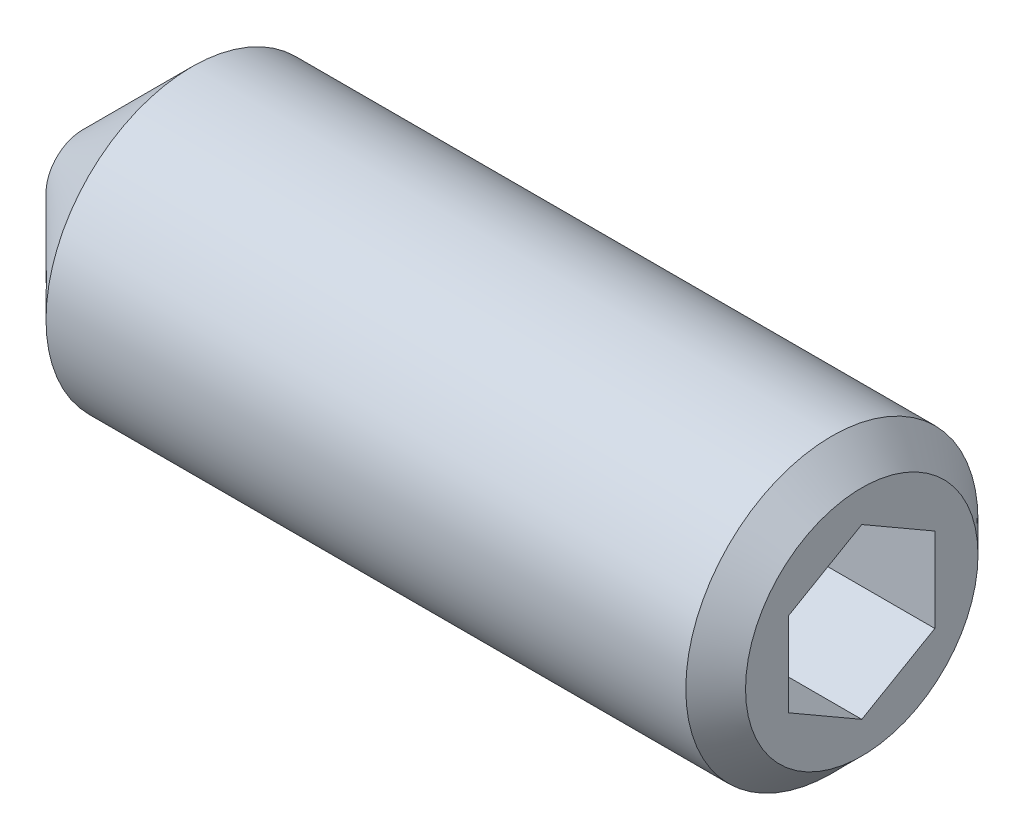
ISO-10303-21;
HEADER;
FILE_DESCRIPTION(('STEP AP214'),'2;1');
FILE_NAME('part.step','',(''),(''),'','','');
FILE_SCHEMA(('AUTOMOTIVE_DESIGN { 1 0 10303 214 1 1 1 1 }'));
ENDSEC;
DATA;
#1=APPLICATION_CONTEXT('core data for automotive mechanical design processes');
#2=APPLICATION_PROTOCOL_DEFINITION('international standard','automotive_design',2000,#1);
#3=PRODUCT_CONTEXT('',#1,'mechanical');
#4=PRODUCT('Part','Part','',(#3));
#5=PRODUCT_RELATED_PRODUCT_CATEGORY('part','',(#4));
#6=PRODUCT_DEFINITION_FORMATION('','',#4);
#7=PRODUCT_DEFINITION_CONTEXT('part definition',#1,'design');
#8=PRODUCT_DEFINITION('design','',#6,#7);
#9=PRODUCT_DEFINITION_SHAPE('','',#8);
#10=(LENGTH_UNIT() NAMED_UNIT(*) SI_UNIT(.MILLI.,.METRE.));
#11=(NAMED_UNIT(*) PLANE_ANGLE_UNIT() SI_UNIT($,.RADIAN.));
#12=(NAMED_UNIT(*) SI_UNIT($,.STERADIAN.) SOLID_ANGLE_UNIT());
#13=UNCERTAINTY_MEASURE_WITH_UNIT(LENGTH_MEASURE(1.E-05),#10,'distance_accuracy_value','');
#14=(GEOMETRIC_REPRESENTATION_CONTEXT(3) GLOBAL_UNCERTAINTY_ASSIGNED_CONTEXT((#13)) GLOBAL_UNIT_ASSIGNED_CONTEXT((#10,
#11,#12)) REPRESENTATION_CONTEXT('',''));
#15=CARTESIAN_POINT('',(0.,0.,0.));
#16=DIRECTION('',(0.,0.,1.));
#17=DIRECTION('',(1.,0.,0.));
#18=AXIS2_PLACEMENT_3D('',#15,#16,#17);
#19=CARTESIAN_POINT('',(16.,0.866025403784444,-1.5));
#20=DIRECTION('',(0.,0.86602540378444,-0.499999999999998));
#21=DIRECTION('',(0.,0.499999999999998,0.86602540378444));
#22=AXIS2_PLACEMENT_3D('',#19,#20,#21);
#23=PLANE('',#22);
#24=DIRECTION('',(-1.,0.,0.));
#25=VECTOR('',#24,1.);
#26=CARTESIAN_POINT('',(16.,0.866025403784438,-1.5));
#27=LINE('',#26,#25);
#28=CARTESIAN_POINT('',(12.4999999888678,0.866025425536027,-1.49999996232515));
#29=VERTEX_POINT('',#28);
#30=CARTESIAN_POINT('',(16.,0.86602540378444,-1.5));
#31=VERTEX_POINT('',#30);
#32=EDGE_CURVE('E185',#29,#31,#27,.F.);
#33=ORIENTED_EDGE('',*,*,#32,.T.);
#34=DIRECTION('',(0.,0.499999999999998,0.86602540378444));
#35=VECTOR('',#34,1.);
#36=CARTESIAN_POINT('',(16.,0.866025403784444,-1.5));
#37=LINE('',#36,#35);
#38=CARTESIAN_POINT('',(16.,1.73205080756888,0.));
#39=VERTEX_POINT('',#38);
#40=EDGE_CURVE('E189',#39,#31,#37,.F.);
#41=ORIENTED_EDGE('',*,*,#40,.F.);
#42=DIRECTION('',(1.,0.,0.));
#43=VECTOR('',#42,1.);
#44=CARTESIAN_POINT('',(16.,1.73205080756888,0.));
#45=LINE('',#44,#43);
#46=CARTESIAN_POINT('',(12.4999999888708,1.73205078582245,3.76659266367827E-08));
#47=VERTEX_POINT('',#46);
#48=EDGE_CURVE('E88',#39,#47,#45,.F.);
#49=ORIENTED_EDGE('',*,*,#48,.T.);
#50=CARTESIAN_POINT('',(12.5000000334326,1.73205078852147,4.14932275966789E-08));
#51=CARTESIAN_POINT('',(12.4780216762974,1.69399423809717,-0.0659158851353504));
#52=CARTESIAN_POINT('',(12.458033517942,1.65560917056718,-0.13240079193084));
#53=CARTESIAN_POINT('',(12.423144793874,1.57817441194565,-0.266521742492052));
#54=CARTESIAN_POINT('',(12.4082565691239,1.53912334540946,-0.334160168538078));
#55=CARTESIAN_POINT('',(12.3850819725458,1.46150515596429,-0.468598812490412));
#56=CARTESIAN_POINT('',(12.376641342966,1.42294997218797,-0.535378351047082));
#57=CARTESIAN_POINT('',(12.3665668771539,1.34565828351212,-0.669251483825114));
#58=CARTESIAN_POINT('',(12.3649246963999,1.30692205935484,-0.736344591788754));
#59=CARTESIAN_POINT('',(12.3683497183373,1.234547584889,-0.86170085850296));
#60=CARTESIAN_POINT('',(12.3725759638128,1.20089847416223,-0.919982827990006));
#61=CARTESIAN_POINT('',(12.3859679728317,1.13381946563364,-1.03616707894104));
#62=CARTESIAN_POINT('',(12.395138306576,1.10038979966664,-1.09406895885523));
#63=CARTESIAN_POINT('',(12.4180623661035,1.0331726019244,-1.21049256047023));
#64=CARTESIAN_POINT('',(12.4319132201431,0.999393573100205,-1.26899955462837));
#65=CARTESIAN_POINT('',(12.4633488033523,0.932339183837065,-1.38514116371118));
#66=CARTESIAN_POINT('',(12.4809261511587,0.899062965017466,-1.44277726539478));
#67=CARTESIAN_POINT('',(12.4999999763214,0.866025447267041,-1.49999992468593));
#68=B_SPLINE_CURVE_WITH_KNOTS('',3,(#50,#51,#52,#53,#54,#55,#56,#57,#58,#59,#60,#61,#62,#63,#64,
#65,#66,#67),.UNSPECIFIED.,.F.,.F.,(4,2,2,2,2,2,2,2,4),(0.,0.237762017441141,0.476095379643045,
0.708530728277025,0.940680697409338,1.14278084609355,1.34506813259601,1.5518411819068,
1.75820842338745),.UNSPECIFIED.);
#69=EDGE_CURVE('E87',#47,#29,#68,.T.);
#70=ORIENTED_EDGE('',*,*,#69,.T.);
#71=EDGE_LOOP('',(#33,#41,#49,#70));
#72=FACE_BOUND('',#71,.T.);
#73=ADVANCED_FACE('F15',(#72),#23,.F.);
#74=CARTESIAN_POINT('',(16.,-0.866025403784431,-1.5));
#75=DIRECTION('',(0.,0.,-1.));
#76=DIRECTION('',(-1.,0.,0.));
#77=AXIS2_PLACEMENT_3D('',#74,#75,#76);
#78=PLANE('',#77);
#79=DIRECTION('',(1.,0.,0.));
#80=VECTOR('',#79,1.);
#81=CARTESIAN_POINT('',(16.,-0.86602540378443,-1.5));
#82=LINE('',#81,#80);
#83=CARTESIAN_POINT('',(12.4999999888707,-0.866025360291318,-1.5));
#84=VERTEX_POINT('',#83);
#85=CARTESIAN_POINT('',(16.,-0.866025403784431,-1.5));
#86=VERTEX_POINT('',#85);
#87=EDGE_CURVE('E184',#84,#86,#82,.T.);
#88=ORIENTED_EDGE('',*,*,#87,.T.);
#89=DIRECTION('',(0.,1.,0.));
#90=VECTOR('',#89,1.);
#91=CARTESIAN_POINT('',(16.,-0.866025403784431,-1.5));
#92=LINE('',#91,#90);
#93=EDGE_CURVE('E182',#31,#86,#92,.F.);
#94=ORIENTED_EDGE('',*,*,#93,.F.);
#95=ORIENTED_EDGE('',*,*,#32,.F.);
#96=CARTESIAN_POINT('',(12.5000000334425,0.86602543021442,-1.4999999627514));
#97=CARTESIAN_POINT('',(12.4780216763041,0.789912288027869,-1.49999998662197));
#98=CARTESIAN_POINT('',(12.4580335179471,0.71314213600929,-1.49999999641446));
#99=CARTESIAN_POINT('',(12.4231447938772,0.558272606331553,-1.50000000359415));
#100=CARTESIAN_POINT('',(12.4082565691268,0.480170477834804,-1.50000000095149));
#101=CARTESIAN_POINT('',(12.3850819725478,0.324934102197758,-1.49999999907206));
#102=CARTESIAN_POINT('',(12.3766413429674,0.247823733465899,-1.49999999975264));
#103=CARTESIAN_POINT('',(12.3665668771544,0.0932403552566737,-1.50000000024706));
#104=CARTESIAN_POINT('',(12.3649246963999,0.0157679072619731,-1.50000000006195));
#105=CARTESIAN_POINT('',(12.3683497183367,-0.12898104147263,-1.49999999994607));
#106=CARTESIAN_POINT('',(12.3725759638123,-0.196279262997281,-1.49999999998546));
#107=CARTESIAN_POINT('',(12.3859679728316,-0.330437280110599,-1.50000000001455));
#108=CARTESIAN_POINT('',(12.3951383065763,-0.397296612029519,-1.5000000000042));
#109=CARTESIAN_POINT('',(12.418062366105,-0.531731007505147,-1.49999999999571));
#110=CARTESIAN_POINT('',(12.4319132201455,-0.599289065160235,-1.49999999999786));
#111=CARTESIAN_POINT('',(12.4633488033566,-0.733397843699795,-1.50000000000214));
#112=CARTESIAN_POINT('',(12.480926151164,-0.79995028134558,-1.50000000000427));
#113=CARTESIAN_POINT('',(12.499999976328,-0.866025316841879,-1.5));
#114=B_SPLINE_CURVE_WITH_KNOTS('',3,(#96,#97,#98,#99,#100,#101,#102,#103,#104,#105,#106,#107,
#108,#109,#110,#111,#112,#113),.UNSPECIFIED.,.F.,.F.,(4,2,2,2,2,2,2,2,4),(0.,0.237762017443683,
0.476095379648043,0.708530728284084,0.940680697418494,1.14278084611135,1.34506813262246,
1.55184118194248,1.75820842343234),.UNSPECIFIED.);
#115=EDGE_CURVE('E128',#29,#84,#114,.T.);
#116=ORIENTED_EDGE('',*,*,#115,.T.);
#117=EDGE_LOOP('',(#88,#94,#95,#116));
#118=FACE_BOUND('',#117,.T.);
#119=ADVANCED_FACE('F132',(#118),#78,.F.);
#120=CARTESIAN_POINT('',(16.,-1.73205080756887,0.));
#121=DIRECTION('',(0.,-0.866025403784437,-0.500000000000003));
#122=DIRECTION('',(0.,0.500000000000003,-0.866025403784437));
#123=AXIS2_PLACEMENT_3D('',#120,#121,#122);
#124=PLANE('',#123);
#125=DIRECTION('',(1.,0.,0.));
#126=VECTOR('',#125,1.);
#127=CARTESIAN_POINT('',(16.,-1.73205080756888,0.));
#128=LINE('',#127,#126);
#129=CARTESIAN_POINT('',(12.4999999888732,-1.73205078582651,-3.76588847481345E-08));
#130=VERTEX_POINT('',#129);
#131=CARTESIAN_POINT('',(16.,-1.73205080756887,0.));
#132=VERTEX_POINT('',#131);
#133=EDGE_CURVE('E188',#130,#132,#128,.T.);
#134=ORIENTED_EDGE('',*,*,#133,.T.);
#135=DIRECTION('',(0.,0.500000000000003,-0.866025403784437));
#136=VECTOR('',#135,1.);
#137=CARTESIAN_POINT('',(16.,-1.73205080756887,0.));
#138=LINE('',#137,#136);
#139=EDGE_CURVE('E186',#86,#132,#138,.F.);
#140=ORIENTED_EDGE('',*,*,#139,.F.);
#141=ORIENTED_EDGE('',*,*,#87,.F.);
#142=CARTESIAN_POINT('',(12.5000000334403,-0.866025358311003,-1.50000000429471));
#143=CARTESIAN_POINT('',(12.4780216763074,-0.904081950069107,-1.43408410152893));
#144=CARTESIAN_POINT('',(12.4580335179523,-0.942467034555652,-1.3675992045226));
#145=CARTESIAN_POINT('',(12.4231447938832,-1.01990180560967,-1.23347826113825));
#146=CARTESIAN_POINT('',(12.4082565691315,-1.05895286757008,-1.16583983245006));
#147=CARTESIAN_POINT('',(12.3850819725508,-1.1365710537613,-1.03140118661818));
#148=CARTESIAN_POINT('',(12.3766413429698,-1.17512623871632,-0.964621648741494));
#149=CARTESIAN_POINT('',(12.3665668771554,-1.25241792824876,-0.830748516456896));
#150=CARTESIAN_POINT('',(12.3649246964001,-1.29115415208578,-0.763655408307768));
#151=CARTESIAN_POINT('',(12.3683497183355,-1.36352862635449,-0.638299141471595));
#152=CARTESIAN_POINT('',(12.3725759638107,-1.39717773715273,-0.580017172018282));
#153=CARTESIAN_POINT('',(12.3859679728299,-1.46425674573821,-0.463832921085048));
#154=CARTESIAN_POINT('',(12.3951383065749,-1.49768641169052,-0.405931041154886));
#155=CARTESIAN_POINT('',(12.4180623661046,-1.56490360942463,-0.289507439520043));
#156=CARTESIAN_POINT('',(12.4319132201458,-1.59868263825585,-0.231000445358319));
#157=CARTESIAN_POINT('',(12.4633488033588,-1.66573702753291,-0.114858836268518));
#158=CARTESIAN_POINT('',(12.4809261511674,-1.69901324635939,-0.0572227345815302));
#159=CARTESIAN_POINT('',(12.4999999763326,-1.73205076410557,-7.52806618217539E-08));
#160=B_SPLINE_CURVE_WITH_KNOTS('',3,(#142,#143,#144,#145,#146,#147,#148,#149,#150,#151,#152,
#153,#154,#155,#156,#157,#158,#159),.UNSPECIFIED.,.F.,.F.,(4,2,2,2,2,2,2,2,4),(0.,
0.23776201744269,0.476095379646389,0.708530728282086,0.940680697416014,1.14278084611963,
1.34506813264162,1.55184118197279,1.75820842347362),.UNSPECIFIED.);
#161=EDGE_CURVE('E123',#84,#130,#160,.T.);
#162=ORIENTED_EDGE('',*,*,#161,.T.);
#163=EDGE_LOOP('',(#134,#140,#141,#162));
#164=FACE_BOUND('',#163,.T.);
#165=ADVANCED_FACE('F135',(#164),#124,.F.);
#166=CARTESIAN_POINT('',(16.,-0.866025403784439,1.5));
#167=DIRECTION('',(0.,-0.86602540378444,0.499999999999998));
#168=DIRECTION('',(0.,-0.499999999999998,-0.86602540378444));
#169=AXIS2_PLACEMENT_3D('',#166,#167,#168);
#170=PLANE('',#169);
#171=DIRECTION('',(1.,0.,0.));
#172=VECTOR('',#171,1.);
#173=CARTESIAN_POINT('',(16.,-0.866025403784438,1.5));
#174=LINE('',#173,#172);
#175=CARTESIAN_POINT('',(12.4999999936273,-0.866025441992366,1.49999996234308));
#176=VERTEX_POINT('',#175);
#177=CARTESIAN_POINT('',(16.,-0.866025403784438,1.5));
#178=VERTEX_POINT('',#177);
#179=EDGE_CURVE('E79',#176,#178,#174,.T.);
#180=ORIENTED_EDGE('',*,*,#179,.T.);
#181=DIRECTION('',(0.,-0.499999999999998,-0.86602540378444));
#182=VECTOR('',#181,1.);
#183=CARTESIAN_POINT('',(16.,-0.866025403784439,1.5));
#184=LINE('',#183,#182);
#185=EDGE_CURVE('E195',#132,#178,#184,.F.);
#186=ORIENTED_EDGE('',*,*,#185,.F.);
#187=ORIENTED_EDGE('',*,*,#133,.F.);
#188=CARTESIAN_POINT('',(12.5000000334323,-1.7320507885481,-4.15121525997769E-08));
#189=CARTESIAN_POINT('',(12.4780216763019,-1.69399423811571,0.0659158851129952));
#190=CARTESIAN_POINT('',(12.4580335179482,-1.6556091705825,0.132400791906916));
#191=CARTESIAN_POINT('',(12.4231447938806,-1.57817441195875,0.266521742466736));
#192=CARTESIAN_POINT('',(12.4082565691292,-1.53912334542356,0.334160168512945));
#193=CARTESIAN_POINT('',(12.3850819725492,-1.46150515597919,0.468598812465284));
#194=CARTESIAN_POINT('',(12.3766413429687,-1.42294997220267,0.535378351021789));
#195=CARTESIAN_POINT('',(12.366566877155,-1.34565828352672,0.669251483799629));
#196=CARTESIAN_POINT('',(12.3649246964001,-1.30692205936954,0.736344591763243));
#197=CARTESIAN_POINT('',(12.3683497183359,-1.2345475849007,0.861700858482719));
#198=CARTESIAN_POINT('',(12.3725759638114,-1.20089847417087,0.919982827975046));
#199=CARTESIAN_POINT('',(12.3859679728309,-1.13381946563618,1.03616707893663));
#200=CARTESIAN_POINT('',(12.3951383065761,-1.10038979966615,1.09406895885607));
#201=CARTESIAN_POINT('',(12.4180623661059,-1.0331726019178,1.21049256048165));
#202=CARTESIAN_POINT('',(12.4319132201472,-0.999393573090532,1.26899955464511));
#203=CARTESIAN_POINT('',(12.4633488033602,-0.932339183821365,1.38514116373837));
#204=CARTESIAN_POINT('',(12.4809261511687,-0.899062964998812,1.44277726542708));
#205=CARTESIAN_POINT('',(12.4999999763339,-0.866025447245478,1.49999992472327));
#206=B_SPLINE_CURVE_WITH_KNOTS('',3,(#188,#189,#190,#191,#192,#193,#194,#195,#196,#197,#198,
#199,#200,#201,#202,#203,#204,#205),.UNSPECIFIED.,.F.,.F.,(4,2,2,2,2,2,2,2,4),(0.,
0.237762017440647,0.476095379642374,0.708530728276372,0.94068069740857,1.14278084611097,
1.34506813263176,1.55184118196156,1.75820842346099),.UNSPECIFIED.);
#207=EDGE_CURVE('E102',#130,#176,#206,.T.);
#208=ORIENTED_EDGE('',*,*,#207,.T.);
#209=EDGE_LOOP('',(#180,#186,#187,#208));
#210=FACE_BOUND('',#209,.T.);
#211=ADVANCED_FACE('F139',(#210),#170,.F.);
#212=CARTESIAN_POINT('',(16.,1.73205080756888,0.));
#213=DIRECTION('',(0.,0.866025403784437,0.500000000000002));
#214=DIRECTION('',(0.,-0.500000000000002,0.866025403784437));
#215=AXIS2_PLACEMENT_3D('',#212,#213,#214);
#216=PLANE('',#215);
#217=ORIENTED_EDGE('',*,*,#48,.F.);
#218=DIRECTION('',(0.,-0.500000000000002,0.866025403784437));
#219=VECTOR('',#218,1.);
#220=CARTESIAN_POINT('',(16.,1.73205080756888,0.));
#221=LINE('',#220,#219);
#222=CARTESIAN_POINT('',(16.,0.866025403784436,1.5));
#223=VERTEX_POINT('',#222);
#224=EDGE_CURVE('E39',#223,#39,#221,.F.);
#225=ORIENTED_EDGE('',*,*,#224,.F.);
#226=DIRECTION('',(1.,0.,0.));
#227=VECTOR('',#226,1.);
#228=CARTESIAN_POINT('',(16.,0.866025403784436,1.5));
#229=LINE('',#228,#227);
#230=CARTESIAN_POINT('',(12.4999999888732,0.86602542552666,1.49999996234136));
#231=VERTEX_POINT('',#230);
#232=EDGE_CURVE('E70',#223,#231,#229,.F.);
#233=ORIENTED_EDGE('',*,*,#232,.T.);
#234=CARTESIAN_POINT('',(12.4999999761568,0.866025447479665,1.49999992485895));
#235=CARTESIAN_POINT('',(12.4780216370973,0.904082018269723,1.43408401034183));
#236=CARTESIAN_POINT('',(12.4580334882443,0.942467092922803,1.36759911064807));
#237=CARTESIAN_POINT('',(12.4231447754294,1.01990185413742,1.23347816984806));
#238=CARTESIAN_POINT('',(12.4082565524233,1.05895291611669,1.16583974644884));
#239=CARTESIAN_POINT('',(12.3850819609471,1.1365710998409,1.0314011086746));
#240=CARTESIAN_POINT('',(12.3766413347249,1.17512628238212,0.964621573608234));
#241=CARTESIAN_POINT('',(12.3665668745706,1.25241796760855,0.830748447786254));
#242=CARTESIAN_POINT('',(12.364924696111,1.29115418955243,0.76365534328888));
#243=CARTESIAN_POINT('',(12.3683497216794,1.36352865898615,0.638299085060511));
#244=CARTESIAN_POINT('',(12.3725759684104,1.39717776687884,0.580017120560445));
#245=CARTESIAN_POINT('',(12.3859679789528,1.46425676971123,0.463832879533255));
#246=CARTESIAN_POINT('',(12.3951383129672,1.49768643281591,0.405931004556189));
#247=CARTESIAN_POINT('',(12.4180623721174,1.56490362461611,0.289507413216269));
#248=CARTESIAN_POINT('',(12.4319132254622,1.59868265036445,0.231000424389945));
#249=CARTESIAN_POINT('',(12.4633488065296,1.66573703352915,0.11485882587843));
#250=CARTESIAN_POINT('',(12.4809261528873,1.69901324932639,0.0572227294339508));
#251=CARTESIAN_POINT('',(12.4999999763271,1.73205076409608,7.52971024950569E-08));
#252=B_SPLINE_CURVE_WITH_KNOTS('',3,(#234,#235,#236,#237,#238,#239,#240,#241,#242,#243,#244,
#245,#246,#247,#248,#249,#250,#251),.UNSPECIFIED.,.F.,.F.,(4,2,2,2,2,2,2,2,4),(0.,
0.237762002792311,0.476095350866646,0.708530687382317,0.940680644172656,1.14278077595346,
1.34506804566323,1.55184107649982,1.75820829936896),.UNSPECIFIED.);
#253=EDGE_CURVE('E19',#231,#47,#252,.T.);
#254=ORIENTED_EDGE('',*,*,#253,.T.);
#255=EDGE_LOOP('',(#217,#225,#233,#254));
#256=FACE_BOUND('',#255,.T.);
#257=ADVANCED_FACE('F72',(#256),#216,.F.);
#258=CARTESIAN_POINT('',(12.5060000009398,0.,0.));
#259=DIRECTION('',(1.,0.,0.));
#260=DIRECTION('',(0.,0.,-1.));
#261=AXIS2_PLACEMENT_3D('',#258,#259,#260);
#262=CONICAL_SURFACE('',#261,1.74244311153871,1.04719754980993);
#263=CARTESIAN_POINT('',(11.4999999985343,-1.70530256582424E-10,0.));
#264=VERTEX_POINT('',#263);
#265=VERTEX_LOOP('',#264);
#266=FACE_BOUND('',#265,.T.);
#267=ORIENTED_EDGE('',*,*,#207,.F.);
#268=ORIENTED_EDGE('',*,*,#161,.F.);
#269=ORIENTED_EDGE('',*,*,#115,.F.);
#270=ORIENTED_EDGE('',*,*,#69,.F.);
#271=ORIENTED_EDGE('',*,*,#253,.F.);
#272=CARTESIAN_POINT('',(12.5000000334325,0.866025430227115,1.4999999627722));
#273=CARTESIAN_POINT('',(12.4780216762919,0.789912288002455,1.49999998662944));
#274=CARTESIAN_POINT('',(12.4580335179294,0.713142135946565,1.49999999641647));
#275=CARTESIAN_POINT('',(12.4231447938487,0.558272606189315,1.50000000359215));
#276=CARTESIAN_POINT('',(12.4082565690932,0.480170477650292,1.50000000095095));
#277=CARTESIAN_POINT('',(12.3850819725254,0.324934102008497,1.49999999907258));
#278=CARTESIAN_POINT('',(12.3766413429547,0.247823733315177,1.49999999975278));
#279=CARTESIAN_POINT('',(12.3665668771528,0.0932403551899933,1.50000000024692));
#280=CARTESIAN_POINT('',(12.3649246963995,0.0157679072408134,1.50000000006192));
#281=CARTESIAN_POINT('',(12.3683497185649,-0.128981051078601,1.4999999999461));
#282=CARTESIAN_POINT('',(12.3725759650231,-0.196279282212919,1.49999999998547));
#283=CARTESIAN_POINT('',(12.3859679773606,-0.330437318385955,1.50000000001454));
#284=CARTESIAN_POINT('',(12.395138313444,-0.397296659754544,1.50000000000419));
#285=CARTESIAN_POINT('',(12.4180623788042,-0.531731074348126,1.49999999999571));
#286=CARTESIAN_POINT('',(12.4319132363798,-0.599289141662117,1.49999999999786));
#287=CARTESIAN_POINT('',(12.4633488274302,-0.73339793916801,1.50000000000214));
#288=CARTESIAN_POINT('',(12.480926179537,-0.799950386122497,1.50000000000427));
#289=CARTESIAN_POINT('',(12.500000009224,-0.866025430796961,1.5));
#290=B_SPLINE_CURVE_WITH_KNOTS('',3,(#272,#273,#274,#275,#276,#277,#278,#279,#280,#281,#282,
#283,#284,#285,#286,#287,#288,#289),.UNSPECIFIED.,.F.,.F.,(4,2,2,2,2,2,2,2,4),(0.,
0.237762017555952,0.476095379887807,0.708530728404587,0.940680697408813,1.14278087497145,
1.34506819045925,1.55184127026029,1.75820854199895),.UNSPECIFIED.);
#291=EDGE_CURVE('E78',#231,#176,#290,.T.);
#292=ORIENTED_EDGE('',*,*,#291,.T.);
#293=EDGE_LOOP('',(#267,#268,#269,#270,#271,#292));
#294=FACE_BOUND('',#293,.T.);
#295=ADVANCED_FACE('F84',(#266,#294),#262,.F.);
#296=CARTESIAN_POINT('',(16.,0.866025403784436,1.5));
#297=DIRECTION('',(0.,0.,1.));
#298=DIRECTION('',(1.,0.,0.));
#299=AXIS2_PLACEMENT_3D('',#296,#297,#298);
#300=PLANE('',#299);
#301=ORIENTED_EDGE('',*,*,#232,.F.);
#302=DIRECTION('',(0.,1.,0.));
#303=VECTOR('',#302,1.);
#304=CARTESIAN_POINT('',(16.,0.,1.5));
#305=LINE('',#304,#303);
#306=EDGE_CURVE('E91',#223,#178,#305,.F.);
#307=ORIENTED_EDGE('',*,*,#306,.T.);
#308=ORIENTED_EDGE('',*,*,#179,.F.);
#309=ORIENTED_EDGE('',*,*,#291,.F.);
#310=EDGE_LOOP('',(#301,#307,#308,#309));
#311=FACE_BOUND('',#310,.T.);
#312=ADVANCED_FACE('F89',(#311),#300,.F.);
#313=CARTESIAN_POINT('',(0.,1.5,0.));
#314=DIRECTION('',(-1.,0.,0.));
#315=DIRECTION('',(0.,0.,1.));
#316=AXIS2_PLACEMENT_3D('',#313,#314,#315);
#317=PLANE('',#316);
#318=CARTESIAN_POINT('',(-9.66338120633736E-10,0.,0.));
#319=DIRECTION('',(1.,0.,0.));
#320=DIRECTION('',(0.,1.,0.));
#321=AXIS2_PLACEMENT_3D('',#318,#319,#320);
#322=CIRCLE('',#321,0.750000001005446);
#323=CARTESIAN_POINT('',(-9.66337686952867E-10,0.750000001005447,0.));
#324=VERTEX_POINT('',#323);
#325=EDGE_CURVE('E93',#324,#324,#322,.T.);
#326=ORIENTED_EDGE('',*,*,#325,.F.);
#327=EDGE_LOOP('',(#326));
#328=FACE_BOUND('',#327,.T.);
#329=ADVANCED_FACE('F166',(#328),#317,.T.);
#330=CARTESIAN_POINT('',(16.,0.,0.));
#331=DIRECTION('',(-1.,0.,0.));
#332=DIRECTION('',(0.,0.,1.));
#333=AXIS2_PLACEMENT_3D('',#330,#331,#332);
#334=PLANE('',#333);
#335=ORIENTED_EDGE('',*,*,#224,.T.);
#336=ORIENTED_EDGE('',*,*,#40,.T.);
#337=ORIENTED_EDGE('',*,*,#93,.T.);
#338=ORIENTED_EDGE('',*,*,#139,.T.);
#339=ORIENTED_EDGE('',*,*,#185,.T.);
#340=ORIENTED_EDGE('',*,*,#306,.F.);
#341=EDGE_LOOP('',(#335,#336,#337,#338,#339,#340));
#342=FACE_BOUND('',#341,.T.);
#343=CARTESIAN_POINT('',(16.0000000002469,0.,0.));
#344=DIRECTION('',(-1.,0.,0.));
#345=DIRECTION('',(0.,0.,1.));
#346=AXIS2_PLACEMENT_3D('',#343,#344,#345);
#347=CIRCLE('',#346,2.38655000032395);
#348=CARTESIAN_POINT('',(16.0000000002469,0.,2.38655000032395));
#349=VERTEX_POINT('',#348);
#350=EDGE_CURVE('E176',#349,#349,#347,.T.);
#351=ORIENTED_EDGE('',*,*,#350,.F.);
#352=EDGE_LOOP('',(#351));
#353=FACE_BOUND('',#352,.T.);
#354=ADVANCED_FACE('F163',(#342,#353),#334,.F.);
#355=CARTESIAN_POINT('',(2.25000000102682,0.,0.));
#356=DIRECTION('',(1.,0.,0.));
#357=DIRECTION('',(0.,1.,0.));
#358=AXIS2_PLACEMENT_3D('',#355,#356,#357);
#359=CONICAL_SURFACE('',#358,2.99999999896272,0.785398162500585);
#360=CARTESIAN_POINT('',(2.25,0.,0.));
#361=DIRECTION('',(1.,0.,0.));
#362=DIRECTION('',(0.,1.,0.));
#363=AXIS2_PLACEMENT_3D('',#360,#361,#362);
#364=CIRCLE('',#363,3.);
#365=CARTESIAN_POINT('',(2.25,2.9999999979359,0.));
#366=VERTEX_POINT('',#365);
#367=EDGE_CURVE('E30',#366,#366,#364,.T.);
#368=CARTESIAN_POINT('',(2.25,2.9999999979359,0.));
#369=CARTESIAN_POINT('',(2.22656249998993,2.97656249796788,0.));
#370=CARTESIAN_POINT('',(2.20312499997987,2.95312499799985,0.));
#371=CARTESIAN_POINT('',(2.15624999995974,2.9062499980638,0.));
#372=CARTESIAN_POINT('',(2.13281249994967,2.88281249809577,0.));
#373=CARTESIAN_POINT('',(2.08593749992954,2.83593749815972,0.));
#374=CARTESIAN_POINT('',(2.06249999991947,2.8124999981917,0.));
#375=CARTESIAN_POINT('',(2.01562499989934,2.76562499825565,0.));
#376=CARTESIAN_POINT('',(1.99218749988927,2.74218749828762,0.));
#377=CARTESIAN_POINT('',(1.94531249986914,2.69531249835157,0.));
#378=CARTESIAN_POINT('',(1.92187499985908,2.67187499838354,0.));
#379=CARTESIAN_POINT('',(1.87499999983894,2.62499999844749,0.));
#380=CARTESIAN_POINT('',(1.85156249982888,2.60156249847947,0.));
#381=CARTESIAN_POINT('',(1.80468749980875,2.55468749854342,0.));
#382=CARTESIAN_POINT('',(1.78124999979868,2.53124999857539,0.));
#383=CARTESIAN_POINT('',(1.73437499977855,2.48437499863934,0.));
#384=CARTESIAN_POINT('',(1.71093749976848,2.46093749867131,0.));
#385=CARTESIAN_POINT('',(1.66406249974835,2.41406249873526,0.));
#386=CARTESIAN_POINT('',(1.64062499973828,2.39062499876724,0.));
#387=CARTESIAN_POINT('',(1.59374999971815,2.34374999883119,0.));
#388=CARTESIAN_POINT('',(1.57031249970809,2.32031249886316,0.));
#389=CARTESIAN_POINT('',(1.52343749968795,2.27343749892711,0.));
#390=CARTESIAN_POINT('',(1.49999999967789,2.24999999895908,0.));
#391=CARTESIAN_POINT('',(1.45312499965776,2.20312499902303,0.));
#392=CARTESIAN_POINT('',(1.42968749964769,2.17968749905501,0.));
#393=CARTESIAN_POINT('',(1.38281249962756,2.13281249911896,0.));
#394=CARTESIAN_POINT('',(1.35937499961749,2.10937499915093,0.));
#395=CARTESIAN_POINT('',(1.31249999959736,2.06249999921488,0.));
#396=CARTESIAN_POINT('',(1.28906249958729,2.03906249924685,0.));
#397=CARTESIAN_POINT('',(1.24218749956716,1.9921874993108,0.));
#398=CARTESIAN_POINT('',(1.2187499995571,1.96874999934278,0.));
#399=CARTESIAN_POINT('',(1.17187499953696,1.92187499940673,0.));
#400=CARTESIAN_POINT('',(1.1484374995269,1.8984374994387,0.));
#401=CARTESIAN_POINT('',(1.10156249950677,1.85156249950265,0.));
#402=CARTESIAN_POINT('',(1.0781249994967,1.82812499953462,0.));
#403=CARTESIAN_POINT('',(1.03124999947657,1.78124999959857,0.));
#404=CARTESIAN_POINT('',(1.0078124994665,1.75781249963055,0.));
#405=CARTESIAN_POINT('',(0.960937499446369,1.7109374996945,0.));
#406=CARTESIAN_POINT('',(0.937499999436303,1.68749999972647,0.));
#407=CARTESIAN_POINT('',(0.890624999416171,1.64062499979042,0.));
#408=CARTESIAN_POINT('',(0.867187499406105,1.61718749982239,0.));
#409=CARTESIAN_POINT('',(0.820312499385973,1.57031249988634,0.));
#410=CARTESIAN_POINT('',(0.796874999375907,1.54687499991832,0.));
#411=CARTESIAN_POINT('',(0.749999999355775,1.49999999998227,0.));
#412=CARTESIAN_POINT('',(0.726562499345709,1.47656250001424,0.));
#413=CARTESIAN_POINT('',(0.679687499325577,1.42968750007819,0.));
#414=CARTESIAN_POINT('',(0.656249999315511,1.40625000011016,0.));
#415=CARTESIAN_POINT('',(0.609374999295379,1.35937500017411,0.));
#416=CARTESIAN_POINT('',(0.585937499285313,1.33593750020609,0.));
#417=CARTESIAN_POINT('',(0.539062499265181,1.28906250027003,0.));
#418=CARTESIAN_POINT('',(0.515624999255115,1.26562500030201,0.));
#419=CARTESIAN_POINT('',(0.468749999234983,1.21875000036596,0.));
#420=CARTESIAN_POINT('',(0.445312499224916,1.19531250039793,0.));
#421=CARTESIAN_POINT('',(0.398437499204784,1.14843750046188,0.));
#422=CARTESIAN_POINT('',(0.374999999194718,1.12500000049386,0.));
#423=CARTESIAN_POINT('',(0.328124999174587,1.0781250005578,0.));
#424=CARTESIAN_POINT('',(0.304687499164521,1.05468750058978,0.));
#425=CARTESIAN_POINT('',(0.257812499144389,1.00781250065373,0.));
#426=CARTESIAN_POINT('',(0.234374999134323,0.984375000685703,0.));
#427=CARTESIAN_POINT('',(0.187499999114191,0.937500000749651,0.));
#428=CARTESIAN_POINT('',(0.164062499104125,0.914062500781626,0.));
#429=CARTESIAN_POINT('',(0.117187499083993,0.867187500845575,0.));
#430=CARTESIAN_POINT('',(0.0937499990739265,0.843750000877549,0.));
#431=CARTESIAN_POINT('',(0.0468749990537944,0.796875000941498,0.));
#432=CARTESIAN_POINT('',(0.0234374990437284,0.773437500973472,0.));
#433=CARTESIAN_POINT('',(-9.66337686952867E-10,0.750000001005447,0.));
#434=B_SPLINE_CURVE_WITH_KNOTS('',3,(#368,#369,#370,#371,#372,#373,#374,#375,#376,#377,#378,
#379,#380,#381,#382,#383,#384,#385,#386,#387,#388,#389,#390,#391,#392,#393,#394,#395,#396,#397,
#398,#399,#400,#401,#402,#403,#404,#405,#406,#407,#408,#409,#410,#411,#412,#413,#414,#415,#416,
#417,#418,#419,#420,#421,#422,#423,#424,#425,#426,#427,#428,#429,#430,#431,#432,#433),
.UNSPECIFIED.,.F.,.F.,(4,2,2,2,2,2,2,2,2,2,2,2,2,2,2,2,2,2,2,2,2,2,2,2,2,2,2,2,2,2,2,2,4),(0.,
0.0994368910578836,0.198873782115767,0.298310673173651,0.397747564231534,0.497184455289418,
0.596621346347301,0.696058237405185,0.795495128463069,0.894932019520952,0.994368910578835,
1.09380580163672,1.1932426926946,1.29267958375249,1.39211647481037,1.49155336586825,
1.59099025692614,1.69042714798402,1.7898640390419,1.88930093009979,1.98873782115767,
2.08817471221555,2.18761160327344,2.28704849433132,2.3864853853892,2.48592227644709,
2.58535916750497,2.68479605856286,2.78423294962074,2.88366984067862,2.98310673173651,
3.08254362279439,3.18198051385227),.UNSPECIFIED.);
#435=EDGE_CURVE('BSEAM156',#366,#324,#434,.T.);
#436=ORIENTED_EDGE('',*,*,#367,.F.);
#437=ORIENTED_EDGE('',*,*,#325,.T.);
#438=ORIENTED_EDGE('',*,*,#435,.T.);
#439=ORIENTED_EDGE('',*,*,#435,.F.);
#440=EDGE_LOOP('',(#436,#438,#437,#439));
#441=FACE_BOUND('',#440,.T.);
#442=ADVANCED_FACE('F156',(#441),#359,.T.);
#443=CARTESIAN_POINT('',(15.3865499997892,0.,0.));
#444=DIRECTION('',(-1.,0.,0.));
#445=DIRECTION('',(0.,0.,1.));
#446=AXIS2_PLACEMENT_3D('',#443,#444,#445);
#447=CONICAL_SURFACE('',#446,2.99999999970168,0.785398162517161);
#448=ORIENTED_EDGE('',*,*,#350,.T.);
#449=EDGE_LOOP('',(#448));
#450=FACE_BOUND('',#449,.T.);
#451=CARTESIAN_POINT('',(15.38655,0.,0.));
#452=DIRECTION('',(1.,0.,0.));
#453=DIRECTION('',(0.,1.,0.));
#454=AXIS2_PLACEMENT_3D('',#451,#452,#453);
#455=CIRCLE('',#454,3.);
#456=CARTESIAN_POINT('',(15.38655,3.,0.));
#457=VERTEX_POINT('',#456);
#458=EDGE_CURVE('E10',#457,#457,#455,.F.);
#459=ORIENTED_EDGE('',*,*,#458,.F.);
#460=EDGE_LOOP('',(#459));
#461=FACE_BOUND('',#460,.T.);
#462=ADVANCED_FACE('F150',(#450,#461),#447,.T.);
#463=CARTESIAN_POINT('',(8.,0.,0.));
#464=DIRECTION('',(1.,0.,0.));
#465=DIRECTION('',(0.,1.,0.));
#466=AXIS2_PLACEMENT_3D('',#463,#464,#465);
#467=CYLINDRICAL_SURFACE('',#466,3.);
#468=ORIENTED_EDGE('',*,*,#458,.T.);
#469=EDGE_LOOP('',(#468));
#470=FACE_BOUND('',#469,.T.);
#471=ORIENTED_EDGE('',*,*,#367,.T.);
#472=EDGE_LOOP('',(#471));
#473=FACE_BOUND('',#472,.T.);
#474=ADVANCED_FACE('F148',(#470,#473),#467,.T.);
#475=CLOSED_SHELL('',(#73,#119,#165,#211,#257,#295,#312,#329,#354,#442,#462,#474));
#476=MANIFOLD_SOLID_BREP('B1',#475);
#477=ADVANCED_BREP_SHAPE_REPRESENTATION('',(#18,#476),#14);
#478=SHAPE_DEFINITION_REPRESENTATION(#9,#477);
ENDSEC;
END-ISO-10303-21;
